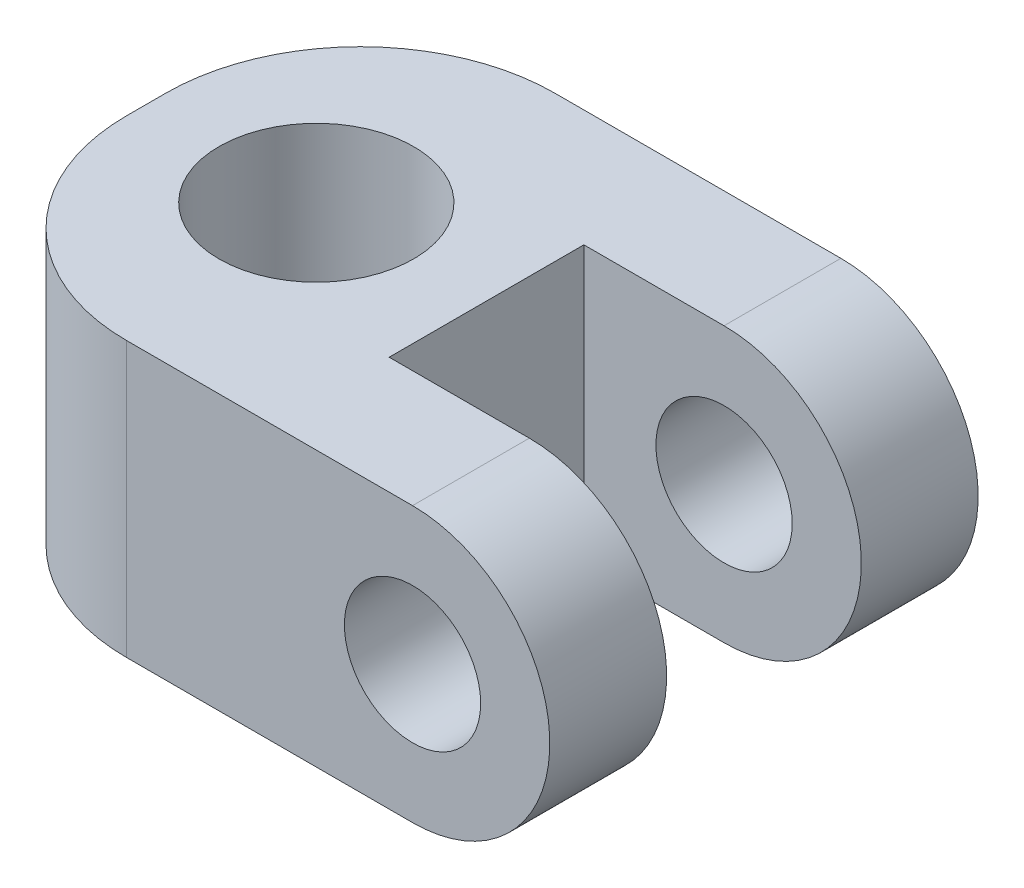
ISO-10303-21;
HEADER;
FILE_DESCRIPTION(('STEP AP214'),'2;1');
FILE_NAME('part.step','',(''),(''),'','','');
FILE_SCHEMA(('AUTOMOTIVE_DESIGN { 1 0 10303 214 1 1 1 1 }'));
ENDSEC;
DATA;
#1=APPLICATION_CONTEXT('core data for automotive mechanical design processes');
#2=APPLICATION_PROTOCOL_DEFINITION('international standard','automotive_design',2000,#1);
#3=PRODUCT_CONTEXT('',#1,'mechanical');
#4=PRODUCT('Part','Part','',(#3));
#5=PRODUCT_RELATED_PRODUCT_CATEGORY('part','',(#4));
#6=PRODUCT_DEFINITION_FORMATION('','',#4);
#7=PRODUCT_DEFINITION_CONTEXT('part definition',#1,'design');
#8=PRODUCT_DEFINITION('design','',#6,#7);
#9=PRODUCT_DEFINITION_SHAPE('','',#8);
#10=(LENGTH_UNIT() NAMED_UNIT(*) SI_UNIT(.MILLI.,.METRE.));
#11=(NAMED_UNIT(*) PLANE_ANGLE_UNIT() SI_UNIT($,.RADIAN.));
#12=(NAMED_UNIT(*) SI_UNIT($,.STERADIAN.) SOLID_ANGLE_UNIT());
#13=UNCERTAINTY_MEASURE_WITH_UNIT(LENGTH_MEASURE(1.E-05),#10,'distance_accuracy_value','');
#14=(GEOMETRIC_REPRESENTATION_CONTEXT(3) GLOBAL_UNCERTAINTY_ASSIGNED_CONTEXT((#13)) GLOBAL_UNIT_ASSIGNED_CONTEXT((#10,
#11,#12)) REPRESENTATION_CONTEXT('',''));
#15=CARTESIAN_POINT('',(0.,0.,0.));
#16=DIRECTION('',(0.,0.,1.));
#17=DIRECTION('',(1.,0.,0.));
#18=AXIS2_PLACEMENT_3D('',#15,#16,#17);
#19=CARTESIAN_POINT('',(-19.075,22.25,3.));
#20=DIRECTION('',(0.,0.,1.));
#21=DIRECTION('',(1.,0.,0.));
#22=AXIS2_PLACEMENT_3D('',#19,#20,#21);
#23=PLANE('',#22);
#24=DIRECTION('',(0.,1.,0.));
#25=VECTOR('',#24,1.);
#26=CARTESIAN_POINT('',(-22.675,25.775,3.));
#27=LINE('',#26,#25);
#28=CARTESIAN_POINT('',(-22.675,18.725,3.));
#29=VERTEX_POINT('',#28);
#30=CARTESIAN_POINT('',(-22.675,25.775,3.));
#31=VERTEX_POINT('',#30);
#32=EDGE_CURVE('E135',#29,#31,#27,.T.);
#33=ORIENTED_EDGE('',*,*,#32,.F.);
#34=DIRECTION('',(1.,0.,0.));
#35=VECTOR('',#34,1.);
#36=CARTESIAN_POINT('',(-31.4162034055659,18.725,3.));
#37=LINE('',#36,#35);
#38=CARTESIAN_POINT('',(-19.075,18.725,3.));
#39=VERTEX_POINT('',#38);
#40=EDGE_CURVE('E165',#29,#39,#37,.T.);
#41=ORIENTED_EDGE('',*,*,#40,.T.);
#42=CARTESIAN_POINT('',(-19.075,22.25,3.));
#43=DIRECTION('',(0.,0.,1.));
#44=DIRECTION('',(1.,0.,0.));
#45=AXIS2_PLACEMENT_3D('',#42,#43,#44);
#46=CIRCLE('',#45,3.525);
#47=CARTESIAN_POINT('',(-19.075,25.775,3.));
#48=VERTEX_POINT('',#47);
#49=EDGE_CURVE('E159',#39,#48,#46,.T.);
#50=ORIENTED_EDGE('',*,*,#49,.T.);
#51=DIRECTION('',(-1.,0.,0.));
#52=VECTOR('',#51,1.);
#53=CARTESIAN_POINT('',(-19.075,25.775,3.));
#54=LINE('',#53,#52);
#55=EDGE_CURVE('E162',#48,#31,#54,.T.);
#56=ORIENTED_EDGE('',*,*,#55,.T.);
#57=EDGE_LOOP('',(#33,#41,#50,#56));
#58=FACE_BOUND('',#57,.T.);
#59=CARTESIAN_POINT('',(-19.075,22.25,3.));
#60=DIRECTION('',(0.,0.,1.));
#61=DIRECTION('',(1.,0.,0.));
#62=AXIS2_PLACEMENT_3D('',#59,#60,#61);
#63=CIRCLE('',#62,1.75);
#64=CARTESIAN_POINT('',(-17.325,22.25,3.));
#65=VERTEX_POINT('',#64);
#66=EDGE_CURVE('E153',#65,#65,#63,.T.);
#67=ORIENTED_EDGE('',*,*,#66,.F.);
#68=EDGE_LOOP('',(#67));
#69=FACE_BOUND('',#68,.T.);
#70=ADVANCED_FACE('F33',(#58,#69),#23,.T.);
#71=CARTESIAN_POINT('',(-19.075,22.25,0.));
#72=DIRECTION('',(0.,0.,1.));
#73=DIRECTION('',(1.,0.,0.));
#74=AXIS2_PLACEMENT_3D('',#71,#72,#73);
#75=PLANE('',#74);
#76=DIRECTION('',(1.,0.,0.));
#77=VECTOR('',#76,1.);
#78=CARTESIAN_POINT('',(-31.4162034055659,18.725,0.));
#79=LINE('',#78,#77);
#80=CARTESIAN_POINT('',(-26.4162034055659,18.725,0.));
#81=VERTEX_POINT('',#80);
#82=CARTESIAN_POINT('',(-19.075,18.725,0.));
#83=VERTEX_POINT('',#82);
#84=EDGE_CURVE('E163',#81,#83,#79,.T.);
#85=ORIENTED_EDGE('',*,*,#84,.F.);
#86=DIRECTION('',(0.,-1.,0.));
#87=VECTOR('',#86,1.);
#88=CARTESIAN_POINT('',(-26.4162034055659,22.25,0.));
#89=LINE('',#88,#87);
#90=CARTESIAN_POINT('',(-26.4162034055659,25.775,0.));
#91=VERTEX_POINT('',#90);
#92=EDGE_CURVE('E11',#81,#91,#89,.F.);
#93=ORIENTED_EDGE('',*,*,#92,.T.);
#94=DIRECTION('',(-1.,0.,0.));
#95=VECTOR('',#94,1.);
#96=CARTESIAN_POINT('',(-19.075,25.775,0.));
#97=LINE('',#96,#95);
#98=CARTESIAN_POINT('',(-19.075,25.775,0.));
#99=VERTEX_POINT('',#98);
#100=EDGE_CURVE('E170',#99,#91,#97,.T.);
#101=ORIENTED_EDGE('',*,*,#100,.F.);
#102=CARTESIAN_POINT('',(-19.075,22.25,0.));
#103=DIRECTION('',(0.,0.,1.));
#104=DIRECTION('',(1.,0.,0.));
#105=AXIS2_PLACEMENT_3D('',#102,#103,#104);
#106=CIRCLE('',#105,3.525);
#107=EDGE_CURVE('E156',#83,#99,#106,.T.);
#108=ORIENTED_EDGE('',*,*,#107,.F.);
#109=EDGE_LOOP('',(#85,#93,#101,#108));
#110=FACE_BOUND('',#109,.T.);
#111=CARTESIAN_POINT('',(-19.075,22.25,0.));
#112=DIRECTION('',(0.,0.,1.));
#113=DIRECTION('',(1.,0.,0.));
#114=AXIS2_PLACEMENT_3D('',#111,#112,#113);
#115=CIRCLE('',#114,1.75);
#116=CARTESIAN_POINT('',(-17.325,22.25,0.));
#117=VERTEX_POINT('',#116);
#118=EDGE_CURVE('E152',#117,#117,#115,.T.);
#119=ORIENTED_EDGE('',*,*,#118,.T.);
#120=EDGE_LOOP('',(#119));
#121=FACE_BOUND('',#120,.T.);
#122=ADVANCED_FACE('F224',(#110,#121),#75,.F.);
#123=CARTESIAN_POINT('',(-19.075,22.25,3.));
#124=DIRECTION('',(0.,0.,-1.));
#125=DIRECTION('',(-1.,0.,0.));
#126=AXIS2_PLACEMENT_3D('',#123,#124,#125);
#127=CYLINDRICAL_SURFACE('',#126,3.525);
#128=ORIENTED_EDGE('',*,*,#107,.T.);
#129=DIRECTION('',(0.,0.,-1.));
#130=VECTOR('',#129,1.);
#131=CARTESIAN_POINT('',(-19.075,25.775,3.));
#132=LINE('',#131,#130);
#133=EDGE_CURVE('E180',#48,#99,#132,.T.);
#134=ORIENTED_EDGE('',*,*,#133,.F.);
#135=ORIENTED_EDGE('',*,*,#49,.F.);
#136=DIRECTION('',(0.,0.,-1.));
#137=VECTOR('',#136,1.);
#138=CARTESIAN_POINT('',(-19.075,18.725,3.));
#139=LINE('',#138,#137);
#140=EDGE_CURVE('E167',#39,#83,#139,.T.);
#141=ORIENTED_EDGE('',*,*,#140,.T.);
#142=EDGE_LOOP('',(#128,#134,#135,#141));
#143=FACE_BOUND('',#142,.T.);
#144=ADVANCED_FACE('F222',(#143),#127,.T.);
#145=CARTESIAN_POINT('',(-19.075,25.775,3.));
#146=DIRECTION('',(0.,-1.,0.));
#147=DIRECTION('',(0.,0.,-1.));
#148=AXIS2_PLACEMENT_3D('',#145,#146,#147);
#149=PLANE('',#148);
#150=CARTESIAN_POINT('',(-27.0456017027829,25.775,5.5));
#151=DIRECTION('',(0.,1.,0.));
#152=DIRECTION('',(0.,0.,1.));
#153=AXIS2_PLACEMENT_3D('',#150,#151,#152);
#154=CIRCLE('',#153,2.5);
#155=CARTESIAN_POINT('',(-27.0456017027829,25.775,8.));
#156=VERTEX_POINT('',#155);
#157=EDGE_CURVE('E384',#156,#156,#154,.T.);
#158=ORIENTED_EDGE('',*,*,#157,.F.);
#159=EDGE_LOOP('',(#158));
#160=FACE_BOUND('',#159,.T.);
#161=DIRECTION('',(0.,0.,-1.));
#162=VECTOR('',#161,1.);
#163=CARTESIAN_POINT('',(-31.4162034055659,25.775,3.));
#164=LINE('',#163,#162);
#165=CARTESIAN_POINT('',(-31.4162034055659,25.775,6.));
#166=VERTEX_POINT('',#165);
#167=CARTESIAN_POINT('',(-31.4162034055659,25.775,5.));
#168=VERTEX_POINT('',#167);
#169=EDGE_CURVE('E178',#166,#168,#164,.T.);
#170=ORIENTED_EDGE('',*,*,#169,.F.);
#171=CARTESIAN_POINT('',(-26.4162034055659,25.775,6.));
#172=DIRECTION('',(0.,-1.,0.));
#173=DIRECTION('',(0.,0.,-1.));
#174=AXIS2_PLACEMENT_3D('',#171,#172,#173);
#175=CIRCLE('',#174,5.);
#176=CARTESIAN_POINT('',(-26.4162034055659,25.775,11.));
#177=VERTEX_POINT('',#176);
#178=EDGE_CURVE('E41',#166,#177,#175,.F.);
#179=ORIENTED_EDGE('',*,*,#178,.T.);
#180=DIRECTION('',(-1.,0.,0.));
#181=VECTOR('',#180,1.);
#182=CARTESIAN_POINT('',(-19.075,25.775,11.));
#183=LINE('',#182,#181);
#184=CARTESIAN_POINT('',(-19.075,25.775,11.));
#185=VERTEX_POINT('',#184);
#186=EDGE_CURVE('E109',#185,#177,#183,.T.);
#187=ORIENTED_EDGE('',*,*,#186,.F.);
#188=DIRECTION('',(0.,0.,-1.));
#189=VECTOR('',#188,1.);
#190=CARTESIAN_POINT('',(-19.075,25.775,11.));
#191=LINE('',#190,#189);
#192=CARTESIAN_POINT('',(-19.075,25.775,8.));
#193=VERTEX_POINT('',#192);
#194=EDGE_CURVE('E114',#185,#193,#191,.T.);
#195=ORIENTED_EDGE('',*,*,#194,.T.);
#196=DIRECTION('',(-1.,0.,0.));
#197=VECTOR('',#196,1.);
#198=CARTESIAN_POINT('',(-19.075,25.775,8.));
#199=LINE('',#198,#197);
#200=CARTESIAN_POINT('',(-22.675,25.775,8.));
#201=VERTEX_POINT('',#200);
#202=EDGE_CURVE('E206',#193,#201,#199,.T.);
#203=ORIENTED_EDGE('',*,*,#202,.T.);
#204=DIRECTION('',(0.,0.,-1.));
#205=VECTOR('',#204,1.);
#206=CARTESIAN_POINT('',(-22.675,25.775,8.));
#207=LINE('',#206,#205);
#208=EDGE_CURVE('E145',#201,#31,#207,.T.);
#209=ORIENTED_EDGE('',*,*,#208,.T.);
#210=ORIENTED_EDGE('',*,*,#55,.F.);
#211=ORIENTED_EDGE('',*,*,#133,.T.);
#212=ORIENTED_EDGE('',*,*,#100,.T.);
#213=CARTESIAN_POINT('',(-26.4162034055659,25.775,5.));
#214=DIRECTION('',(0.,-1.,0.));
#215=DIRECTION('',(0.,0.,-1.));
#216=AXIS2_PLACEMENT_3D('',#213,#214,#215);
#217=CIRCLE('',#216,5.);
#218=EDGE_CURVE('E53',#91,#168,#217,.F.);
#219=ORIENTED_EDGE('',*,*,#218,.T.);
#220=EDGE_LOOP('',(#170,#179,#187,#195,#203,#209,#210,#211,#212,#219));
#221=FACE_BOUND('',#220,.T.);
#222=ADVANCED_FACE('F111',(#160,#221),#149,.F.);
#223=CARTESIAN_POINT('',(-31.4162034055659,25.775,3.));
#224=DIRECTION('',(1.,0.,0.));
#225=DIRECTION('',(0.,0.,-1.));
#226=AXIS2_PLACEMENT_3D('',#223,#224,#225);
#227=PLANE('',#226);
#228=DIRECTION('',(0.,0.,-1.));
#229=VECTOR('',#228,1.);
#230=CARTESIAN_POINT('',(-31.4162034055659,18.725,3.));
#231=LINE('',#230,#229);
#232=CARTESIAN_POINT('',(-31.4162034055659,18.725,6.));
#233=VERTEX_POINT('',#232);
#234=CARTESIAN_POINT('',(-31.4162034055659,18.725,5.));
#235=VERTEX_POINT('',#234);
#236=EDGE_CURVE('E175',#233,#235,#231,.T.);
#237=ORIENTED_EDGE('',*,*,#236,.F.);
#238=DIRECTION('',(0.,-1.,0.));
#239=VECTOR('',#238,1.);
#240=CARTESIAN_POINT('',(-31.4162034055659,25.775,6.));
#241=LINE('',#240,#239);
#242=EDGE_CURVE('E192',#233,#166,#241,.F.);
#243=ORIENTED_EDGE('',*,*,#242,.T.);
#244=ORIENTED_EDGE('',*,*,#169,.T.);
#245=DIRECTION('',(0.,-1.,0.));
#246=VECTOR('',#245,1.);
#247=CARTESIAN_POINT('',(-31.4162034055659,25.775,5.));
#248=LINE('',#247,#246);
#249=EDGE_CURVE('E189',#168,#235,#248,.T.);
#250=ORIENTED_EDGE('',*,*,#249,.T.);
#251=EDGE_LOOP('',(#237,#243,#244,#250));
#252=FACE_BOUND('',#251,.T.);
#253=ADVANCED_FACE('F197',(#252),#227,.F.);
#254=CARTESIAN_POINT('',(-31.4162034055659,18.725,3.));
#255=DIRECTION('',(0.,1.,0.));
#256=DIRECTION('',(0.,0.,1.));
#257=AXIS2_PLACEMENT_3D('',#254,#255,#256);
#258=PLANE('',#257);
#259=CARTESIAN_POINT('',(-27.0456017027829,18.725,5.5));
#260=DIRECTION('',(0.,1.,0.));
#261=DIRECTION('',(0.,0.,1.));
#262=AXIS2_PLACEMENT_3D('',#259,#260,#261);
#263=CIRCLE('',#262,2.5);
#264=CARTESIAN_POINT('',(-27.0456017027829,18.725,8.));
#265=VERTEX_POINT('',#264);
#266=EDGE_CURVE('E379',#265,#265,#263,.T.);
#267=ORIENTED_EDGE('',*,*,#266,.T.);
#268=EDGE_LOOP('',(#267));
#269=FACE_BOUND('',#268,.T.);
#270=DIRECTION('',(1.,0.,0.));
#271=VECTOR('',#270,1.);
#272=CARTESIAN_POINT('',(-31.4162034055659,18.725,11.));
#273=LINE('',#272,#271);
#274=CARTESIAN_POINT('',(-26.4162034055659,18.725,11.));
#275=VERTEX_POINT('',#274);
#276=CARTESIAN_POINT('',(-19.075,18.725,11.));
#277=VERTEX_POINT('',#276);
#278=EDGE_CURVE('E120',#275,#277,#273,.T.);
#279=ORIENTED_EDGE('',*,*,#278,.F.);
#280=CARTESIAN_POINT('',(-26.4162034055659,18.725,6.));
#281=DIRECTION('',(0.,1.,0.));
#282=DIRECTION('',(0.,0.,1.));
#283=AXIS2_PLACEMENT_3D('',#280,#281,#282);
#284=CIRCLE('',#283,5.);
#285=EDGE_CURVE('E187',#275,#233,#284,.F.);
#286=ORIENTED_EDGE('',*,*,#285,.T.);
#287=ORIENTED_EDGE('',*,*,#236,.T.);
#288=CARTESIAN_POINT('',(-26.4162034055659,18.725,5.));
#289=DIRECTION('',(0.,1.,0.));
#290=DIRECTION('',(0.,0.,1.));
#291=AXIS2_PLACEMENT_3D('',#288,#289,#290);
#292=CIRCLE('',#291,5.);
#293=EDGE_CURVE('E185',#235,#81,#292,.F.);
#294=ORIENTED_EDGE('',*,*,#293,.T.);
#295=ORIENTED_EDGE('',*,*,#84,.T.);
#296=ORIENTED_EDGE('',*,*,#140,.F.);
#297=ORIENTED_EDGE('',*,*,#40,.F.);
#298=DIRECTION('',(0.,0.,-1.));
#299=VECTOR('',#298,1.);
#300=CARTESIAN_POINT('',(-22.675,18.725,8.));
#301=LINE('',#300,#299);
#302=CARTESIAN_POINT('',(-22.675,18.725,8.));
#303=VERTEX_POINT('',#302);
#304=EDGE_CURVE('E149',#303,#29,#301,.T.);
#305=ORIENTED_EDGE('',*,*,#304,.F.);
#306=DIRECTION('',(1.,0.,0.));
#307=VECTOR('',#306,1.);
#308=CARTESIAN_POINT('',(-31.4162034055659,18.725,8.));
#309=LINE('',#308,#307);
#310=CARTESIAN_POINT('',(-19.075,18.725,8.));
#311=VERTEX_POINT('',#310);
#312=EDGE_CURVE('E130',#303,#311,#309,.T.);
#313=ORIENTED_EDGE('',*,*,#312,.T.);
#314=DIRECTION('',(0.,0.,-1.));
#315=VECTOR('',#314,1.);
#316=CARTESIAN_POINT('',(-19.075,18.725,11.));
#317=LINE('',#316,#315);
#318=EDGE_CURVE('E136',#277,#311,#317,.T.);
#319=ORIENTED_EDGE('',*,*,#318,.F.);
#320=EDGE_LOOP('',(#279,#286,#287,#294,#295,#296,#297,#305,#313,#319));
#321=FACE_BOUND('',#320,.T.);
#322=ADVANCED_FACE('F202',(#269,#321),#258,.F.);
#323=CARTESIAN_POINT('',(-19.075,22.25,3.));
#324=DIRECTION('',(0.,0.,-1.));
#325=DIRECTION('',(-1.,0.,0.));
#326=AXIS2_PLACEMENT_3D('',#323,#324,#325);
#327=CYLINDRICAL_SURFACE('',#326,1.75);
#328=ORIENTED_EDGE('',*,*,#66,.T.);
#329=EDGE_LOOP('',(#328));
#330=FACE_BOUND('',#329,.T.);
#331=ORIENTED_EDGE('',*,*,#118,.F.);
#332=EDGE_LOOP('',(#331));
#333=FACE_BOUND('',#332,.T.);
#334=ADVANCED_FACE('F230',(#330,#333),#327,.F.);
#335=CARTESIAN_POINT('',(-22.675,25.775,8.));
#336=DIRECTION('',(-1.,0.,0.));
#337=DIRECTION('',(0.,0.,1.));
#338=AXIS2_PLACEMENT_3D('',#335,#336,#337);
#339=PLANE('',#338);
#340=ORIENTED_EDGE('',*,*,#32,.T.);
#341=ORIENTED_EDGE('',*,*,#208,.F.);
#342=DIRECTION('',(0.,1.,0.));
#343=VECTOR('',#342,1.);
#344=CARTESIAN_POINT('',(-22.675,25.775,8.));
#345=LINE('',#344,#343);
#346=EDGE_CURVE('E139',#303,#201,#345,.T.);
#347=ORIENTED_EDGE('',*,*,#346,.F.);
#348=ORIENTED_EDGE('',*,*,#304,.T.);
#349=EDGE_LOOP('',(#340,#341,#347,#348));
#350=FACE_BOUND('',#349,.T.);
#351=ADVANCED_FACE('F214',(#350),#339,.F.);
#352=CARTESIAN_POINT('',(-19.075,22.25,8.));
#353=DIRECTION('',(0.,0.,1.));
#354=DIRECTION('',(1.,0.,0.));
#355=AXIS2_PLACEMENT_3D('',#352,#353,#354);
#356=PLANE('',#355);
#357=CARTESIAN_POINT('',(-19.075,22.25,8.));
#358=DIRECTION('',(0.,0.,1.));
#359=DIRECTION('',(1.,0.,0.));
#360=AXIS2_PLACEMENT_3D('',#357,#358,#359);
#361=CIRCLE('',#360,1.75);
#362=CARTESIAN_POINT('',(-17.325,22.25,8.));
#363=VERTEX_POINT('',#362);
#364=EDGE_CURVE('E377',#363,#363,#361,.T.);
#365=ORIENTED_EDGE('',*,*,#364,.T.);
#366=EDGE_LOOP('',(#365));
#367=FACE_BOUND('',#366,.T.);
#368=ORIENTED_EDGE('',*,*,#312,.F.);
#369=ORIENTED_EDGE('',*,*,#346,.T.);
#370=ORIENTED_EDGE('',*,*,#202,.F.);
#371=CARTESIAN_POINT('',(-19.075,22.25,8.));
#372=DIRECTION('',(0.,0.,1.));
#373=DIRECTION('',(1.,0.,0.));
#374=AXIS2_PLACEMENT_3D('',#371,#372,#373);
#375=CIRCLE('',#374,3.525);
#376=EDGE_CURVE('E134',#311,#193,#375,.T.);
#377=ORIENTED_EDGE('',*,*,#376,.F.);
#378=EDGE_LOOP('',(#368,#369,#370,#377));
#379=FACE_BOUND('',#378,.T.);
#380=ADVANCED_FACE('F212',(#367,#379),#356,.F.);
#381=CARTESIAN_POINT('',(-19.075,22.25,11.));
#382=DIRECTION('',(0.,0.,1.));
#383=DIRECTION('',(1.,0.,0.));
#384=AXIS2_PLACEMENT_3D('',#381,#382,#383);
#385=PLANE('',#384);
#386=ORIENTED_EDGE('',*,*,#186,.T.);
#387=DIRECTION('',(0.,-1.,0.));
#388=VECTOR('',#387,1.);
#389=CARTESIAN_POINT('',(-26.4162034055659,18.725,11.));
#390=LINE('',#389,#388);
#391=EDGE_CURVE('E183',#177,#275,#390,.T.);
#392=ORIENTED_EDGE('',*,*,#391,.T.);
#393=ORIENTED_EDGE('',*,*,#278,.T.);
#394=CARTESIAN_POINT('',(-19.075,22.25,11.));
#395=DIRECTION('',(0.,0.,1.));
#396=DIRECTION('',(1.,0.,0.));
#397=AXIS2_PLACEMENT_3D('',#394,#395,#396);
#398=CIRCLE('',#397,3.525);
#399=EDGE_CURVE('E121',#277,#185,#398,.T.);
#400=ORIENTED_EDGE('',*,*,#399,.T.);
#401=EDGE_LOOP('',(#386,#392,#393,#400));
#402=FACE_BOUND('',#401,.T.);
#403=CARTESIAN_POINT('',(-19.075,22.25,11.));
#404=DIRECTION('',(0.,0.,1.));
#405=DIRECTION('',(1.,0.,0.));
#406=AXIS2_PLACEMENT_3D('',#403,#404,#405);
#407=CIRCLE('',#406,1.75);
#408=CARTESIAN_POINT('',(-17.325,22.25,11.));
#409=VERTEX_POINT('',#408);
#410=EDGE_CURVE('E207',#409,#409,#407,.T.);
#411=ORIENTED_EDGE('',*,*,#410,.F.);
#412=EDGE_LOOP('',(#411));
#413=FACE_BOUND('',#412,.T.);
#414=ADVANCED_FACE('F124',(#402,#413),#385,.T.);
#415=CARTESIAN_POINT('',(-19.075,22.25,11.));
#416=DIRECTION('',(0.,0.,-1.));
#417=DIRECTION('',(-1.,0.,0.));
#418=AXIS2_PLACEMENT_3D('',#415,#416,#417);
#419=CYLINDRICAL_SURFACE('',#418,3.525);
#420=ORIENTED_EDGE('',*,*,#376,.T.);
#421=ORIENTED_EDGE('',*,*,#194,.F.);
#422=ORIENTED_EDGE('',*,*,#399,.F.);
#423=ORIENTED_EDGE('',*,*,#318,.T.);
#424=EDGE_LOOP('',(#420,#421,#422,#423));
#425=FACE_BOUND('',#424,.T.);
#426=ADVANCED_FACE('F132',(#425),#419,.T.);
#427=CARTESIAN_POINT('',(-19.075,22.25,11.));
#428=DIRECTION('',(0.,0.,-1.));
#429=DIRECTION('',(-1.,0.,0.));
#430=AXIS2_PLACEMENT_3D('',#427,#428,#429);
#431=CYLINDRICAL_SURFACE('',#430,1.75);
#432=ORIENTED_EDGE('',*,*,#410,.T.);
#433=EDGE_LOOP('',(#432));
#434=FACE_BOUND('',#433,.T.);
#435=ORIENTED_EDGE('',*,*,#364,.F.);
#436=EDGE_LOOP('',(#435));
#437=FACE_BOUND('',#436,.T.);
#438=ADVANCED_FACE('F258',(#434,#437),#431,.F.);
#439=CARTESIAN_POINT('',(-27.0456017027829,18.725,5.5));
#440=DIRECTION('',(0.,1.,0.));
#441=DIRECTION('',(0.,0.,1.));
#442=AXIS2_PLACEMENT_3D('',#439,#440,#441);
#443=CYLINDRICAL_SURFACE('',#442,2.5);
#444=ORIENTED_EDGE('',*,*,#266,.F.);
#445=EDGE_LOOP('',(#444));
#446=FACE_BOUND('',#445,.T.);
#447=ORIENTED_EDGE('',*,*,#157,.T.);
#448=EDGE_LOOP('',(#447));
#449=FACE_BOUND('',#448,.T.);
#450=ADVANCED_FACE('F253',(#446,#449),#443,.F.);
#451=CARTESIAN_POINT('',(-26.4162034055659,22.25,6.));
#452=DIRECTION('',(0.,1.,0.));
#453=DIRECTION('',(0.,0.,1.));
#454=AXIS2_PLACEMENT_3D('',#451,#452,#453);
#455=CYLINDRICAL_SURFACE('',#454,5.);
#456=ORIENTED_EDGE('',*,*,#178,.F.);
#457=ORIENTED_EDGE('',*,*,#242,.F.);
#458=ORIENTED_EDGE('',*,*,#285,.F.);
#459=ORIENTED_EDGE('',*,*,#391,.F.);
#460=EDGE_LOOP('',(#456,#457,#458,#459));
#461=FACE_BOUND('',#460,.T.);
#462=ADVANCED_FACE('F200',(#461),#455,.T.);
#463=CARTESIAN_POINT('',(-26.4162034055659,25.775,5.));
#464=DIRECTION('',(0.,-1.,0.));
#465=DIRECTION('',(0.,0.,-1.));
#466=AXIS2_PLACEMENT_3D('',#463,#464,#465);
#467=CYLINDRICAL_SURFACE('',#466,5.);
#468=ORIENTED_EDGE('',*,*,#218,.F.);
#469=ORIENTED_EDGE('',*,*,#92,.F.);
#470=ORIENTED_EDGE('',*,*,#293,.F.);
#471=ORIENTED_EDGE('',*,*,#249,.F.);
#472=EDGE_LOOP('',(#468,#469,#470,#471));
#473=FACE_BOUND('',#472,.T.);
#474=ADVANCED_FACE('F35',(#473),#467,.T.);
#475=CLOSED_SHELL('',(#70,#122,#144,#222,#253,#322,#334,#351,#380,#414,#426,#438,#450,#462,#474));
#476=MANIFOLD_SOLID_BREP('B2',#475);
#477=ADVANCED_BREP_SHAPE_REPRESENTATION('',(#18,#476),#14);
#478=SHAPE_DEFINITION_REPRESENTATION(#9,#477);
ENDSEC;
END-ISO-10303-21;
